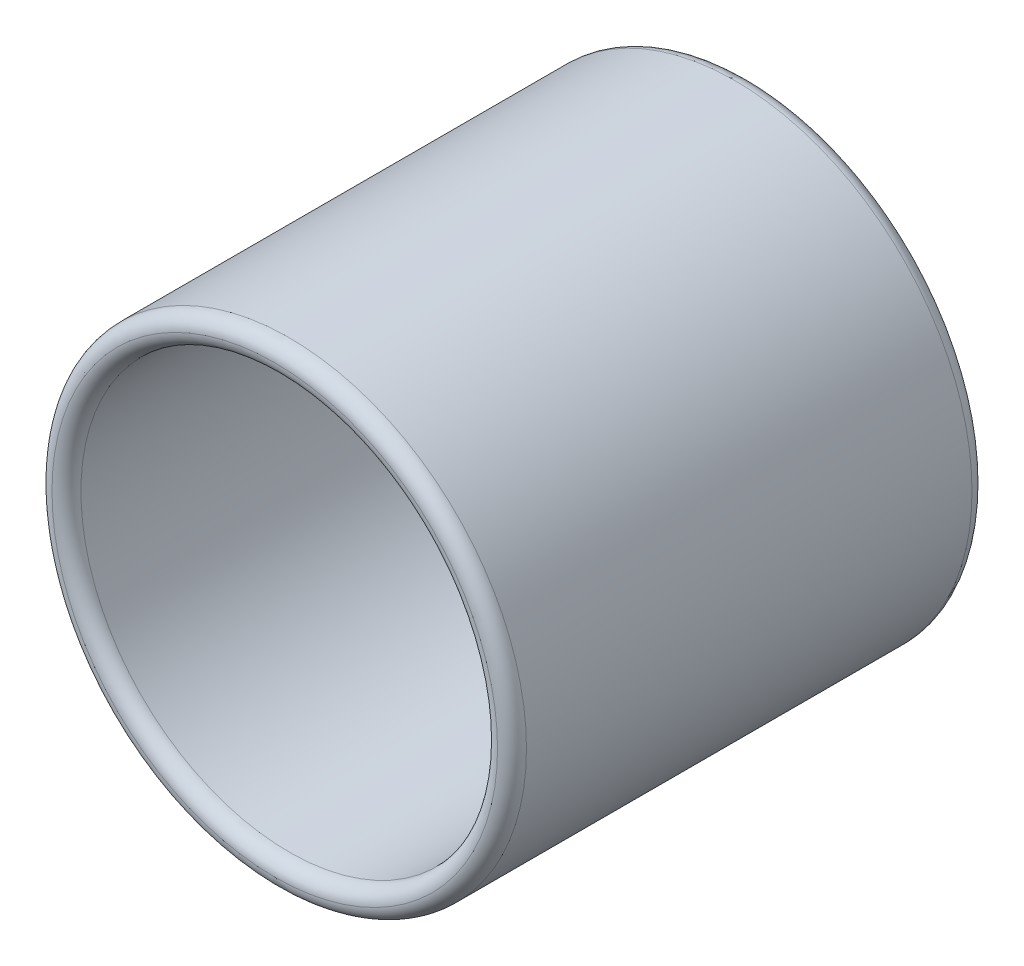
ISO-10303-21;
HEADER;
FILE_DESCRIPTION(('STEP AP214'),'2;1');
FILE_NAME('part.step','',(''),(''),'','','');
FILE_SCHEMA(('AUTOMOTIVE_DESIGN { 1 0 10303 214 1 1 1 1 }'));
ENDSEC;
DATA;
#1=APPLICATION_CONTEXT('core data for automotive mechanical design processes');
#2=APPLICATION_PROTOCOL_DEFINITION('international standard','automotive_design',2000,#1);
#3=PRODUCT_CONTEXT('',#1,'mechanical');
#4=PRODUCT('Part','Part','',(#3));
#5=PRODUCT_RELATED_PRODUCT_CATEGORY('part','',(#4));
#6=PRODUCT_DEFINITION_FORMATION('','',#4);
#7=PRODUCT_DEFINITION_CONTEXT('part definition',#1,'design');
#8=PRODUCT_DEFINITION('design','',#6,#7);
#9=PRODUCT_DEFINITION_SHAPE('','',#8);
#10=(LENGTH_UNIT() NAMED_UNIT(*) SI_UNIT(.MILLI.,.METRE.));
#11=(NAMED_UNIT(*) PLANE_ANGLE_UNIT() SI_UNIT($,.RADIAN.));
#12=(NAMED_UNIT(*) SI_UNIT($,.STERADIAN.) SOLID_ANGLE_UNIT());
#13=UNCERTAINTY_MEASURE_WITH_UNIT(LENGTH_MEASURE(1.E-05),#10,'distance_accuracy_value','');
#14=(GEOMETRIC_REPRESENTATION_CONTEXT(3) GLOBAL_UNCERTAINTY_ASSIGNED_CONTEXT((#13)) GLOBAL_UNIT_ASSIGNED_CONTEXT((#10,
#11,#12)) REPRESENTATION_CONTEXT('',''));
#15=CARTESIAN_POINT('',(0.,0.,0.));
#16=DIRECTION('',(0.,0.,1.));
#17=DIRECTION('',(1.,0.,0.));
#18=AXIS2_PLACEMENT_3D('',#15,#16,#17);
#19=CARTESIAN_POINT('',(0.,0.,8.2));
#20=DIRECTION('',(0.,0.,-1.));
#21=DIRECTION('',(-1.,0.,0.));
#22=AXIS2_PLACEMENT_3D('',#19,#20,#21);
#23=CYLINDRICAL_SURFACE('',#22,4.1);
#24=CARTESIAN_POINT('',(0.,0.,0.25));
#25=DIRECTION('',(0.,0.,1.));
#26=DIRECTION('',(1.,0.,0.));
#27=AXIS2_PLACEMENT_3D('',#24,#25,#26);
#28=CIRCLE('',#27,4.1);
#29=CARTESIAN_POINT('',(4.1,0.,0.25));
#30=VERTEX_POINT('',#29);
#31=EDGE_CURVE('E10',#30,#30,#28,.T.);
#32=ORIENTED_EDGE('',*,*,#31,.T.);
#33=EDGE_LOOP('',(#32));
#34=FACE_BOUND('',#33,.T.);
#35=CARTESIAN_POINT('',(0.,0.,7.95));
#36=DIRECTION('',(0.,0.,1.));
#37=DIRECTION('',(1.,0.,0.));
#38=AXIS2_PLACEMENT_3D('',#35,#36,#37);
#39=CIRCLE('',#38,4.1);
#40=CARTESIAN_POINT('',(4.1,0.,7.95));
#41=VERTEX_POINT('',#40);
#42=EDGE_CURVE('E46',#41,#41,#39,.F.);
#43=ORIENTED_EDGE('',*,*,#42,.T.);
#44=EDGE_LOOP('',(#43));
#45=FACE_BOUND('',#44,.T.);
#46=ADVANCED_FACE('F37',(#34,#45),#23,.T.);
#47=CARTESIAN_POINT('',(0.,0.,8.2));
#48=DIRECTION('',(0.,0.,-1.));
#49=DIRECTION('',(-1.,0.,0.));
#50=AXIS2_PLACEMENT_3D('',#47,#48,#49);
#51=CYLINDRICAL_SURFACE('',#50,3.6);
#52=CARTESIAN_POINT('',(0.,0.,0.25));
#53=DIRECTION('',(0.,0.,1.));
#54=DIRECTION('',(1.,0.,0.));
#55=AXIS2_PLACEMENT_3D('',#52,#53,#54);
#56=CIRCLE('',#55,3.6);
#57=CARTESIAN_POINT('',(3.6,0.,0.25));
#58=VERTEX_POINT('',#57);
#59=EDGE_CURVE('E52',#58,#58,#56,.F.);
#60=ORIENTED_EDGE('',*,*,#59,.T.);
#61=EDGE_LOOP('',(#60));
#62=FACE_BOUND('',#61,.T.);
#63=CARTESIAN_POINT('',(0.,0.,7.95));
#64=DIRECTION('',(0.,0.,1.));
#65=DIRECTION('',(1.,0.,0.));
#66=AXIS2_PLACEMENT_3D('',#63,#64,#65);
#67=CIRCLE('',#66,3.6);
#68=CARTESIAN_POINT('',(3.6,0.,7.95));
#69=VERTEX_POINT('',#68);
#70=EDGE_CURVE('E58',#69,#69,#67,.T.);
#71=ORIENTED_EDGE('',*,*,#70,.T.);
#72=EDGE_LOOP('',(#71));
#73=FACE_BOUND('',#72,.T.);
#74=ADVANCED_FACE('F83',(#62,#73),#51,.F.);
#75=CARTESIAN_POINT('',(0.,0.,0.25));
#76=DIRECTION('',(0.,0.,1.));
#77=DIRECTION('',(1.,0.,0.));
#78=AXIS2_PLACEMENT_3D('',#75,#76,#77);
#79=TOROIDAL_SURFACE('',#78,3.85,0.25);
#80=ORIENTED_EDGE('',*,*,#31,.F.);
#81=EDGE_LOOP('',(#80));
#82=FACE_BOUND('',#81,.T.);
#83=CARTESIAN_POINT('',(0.,0.,0.));
#84=DIRECTION('',(0.,0.,1.));
#85=DIRECTION('',(1.,0.,0.));
#86=AXIS2_PLACEMENT_3D('',#83,#84,#85);
#87=CIRCLE('',#86,3.85);
#88=CARTESIAN_POINT('',(3.85,0.,0.));
#89=VERTEX_POINT('',#88);
#90=EDGE_CURVE('E55',#89,#89,#87,.F.);
#91=ORIENTED_EDGE('',*,*,#90,.F.);
#92=EDGE_LOOP('',(#91));
#93=FACE_BOUND('',#92,.T.);
#94=ADVANCED_FACE('F78',(#82,#93),#79,.T.);
#95=CARTESIAN_POINT('',(0.,0.,0.25));
#96=DIRECTION('',(0.,0.,1.));
#97=DIRECTION('',(1.,0.,0.));
#98=AXIS2_PLACEMENT_3D('',#95,#96,#97);
#99=TOROIDAL_SURFACE('',#98,3.85,0.25);
#100=ORIENTED_EDGE('',*,*,#59,.F.);
#101=EDGE_LOOP('',(#100));
#102=FACE_BOUND('',#101,.T.);
#103=ORIENTED_EDGE('',*,*,#90,.T.);
#104=EDGE_LOOP('',(#103));
#105=FACE_BOUND('',#104,.T.);
#106=ADVANCED_FACE('F71',(#102,#105),#99,.T.);
#107=CARTESIAN_POINT('',(0.,0.,7.95));
#108=DIRECTION('',(0.,0.,1.));
#109=DIRECTION('',(1.,0.,0.));
#110=AXIS2_PLACEMENT_3D('',#107,#108,#109);
#111=TOROIDAL_SURFACE('',#110,3.85,0.25);
#112=ORIENTED_EDGE('',*,*,#70,.F.);
#113=EDGE_LOOP('',(#112));
#114=FACE_BOUND('',#113,.T.);
#115=CARTESIAN_POINT('',(0.,0.,8.2));
#116=DIRECTION('',(0.,0.,1.));
#117=DIRECTION('',(1.,0.,0.));
#118=AXIS2_PLACEMENT_3D('',#115,#116,#117);
#119=CIRCLE('',#118,3.85);
#120=CARTESIAN_POINT('',(3.85,0.,8.2));
#121=VERTEX_POINT('',#120);
#122=EDGE_CURVE('E41',#121,#121,#119,.F.);
#123=ORIENTED_EDGE('',*,*,#122,.F.);
#124=EDGE_LOOP('',(#123));
#125=FACE_BOUND('',#124,.T.);
#126=ADVANCED_FACE('F39',(#114,#125),#111,.T.);
#127=CARTESIAN_POINT('',(0.,0.,7.95));
#128=DIRECTION('',(0.,0.,1.));
#129=DIRECTION('',(1.,0.,0.));
#130=AXIS2_PLACEMENT_3D('',#127,#128,#129);
#131=TOROIDAL_SURFACE('',#130,3.85,0.25);
#132=ORIENTED_EDGE('',*,*,#42,.F.);
#133=EDGE_LOOP('',(#132));
#134=FACE_BOUND('',#133,.T.);
#135=ORIENTED_EDGE('',*,*,#122,.T.);
#136=EDGE_LOOP('',(#135));
#137=FACE_BOUND('',#136,.T.);
#138=ADVANCED_FACE('F68',(#134,#137),#131,.T.);
#139=CLOSED_SHELL('',(#46,#74,#94,#106,#126,#138));
#140=MANIFOLD_SOLID_BREP('B2',#139);
#141=ADVANCED_BREP_SHAPE_REPRESENTATION('',(#18,#140),#14);
#142=SHAPE_DEFINITION_REPRESENTATION(#9,#141);
ENDSEC;
END-ISO-10303-21;
